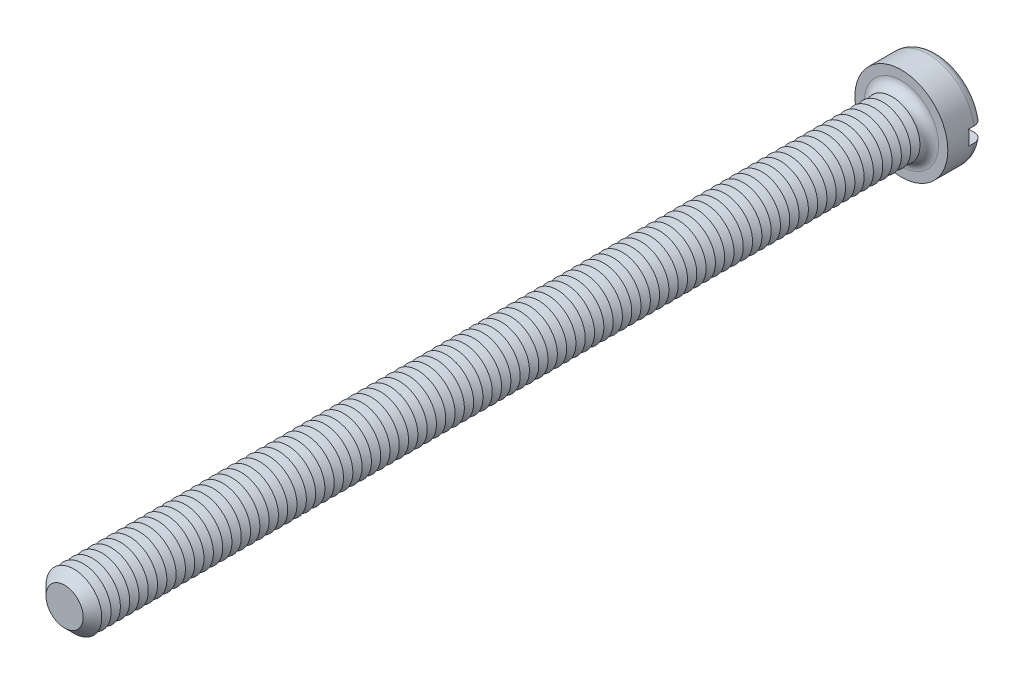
from build123d import *

# Parameters (mm, degrees)
SKETCH3_R           = 5
BOSS_EXTRUDE2_DEPTH = 3.9
SKETCH4_R           = 3
BOSS_EXTRUDE3_DEPTH = 90
FILLET1_R           = 1
CHAMFER1_SIZE       = 1
LPATTERN1_COUNT     = 88
LPATTERN1_PITCH     = 1
SKETCH8_W           = 10
SKETCH8_H           = 1.6
CUT_EXTRUDE1_DEPTH  = 1.6


with BuildPart() as part:
    # Sketch3 → Boss-Extrude2 (new body)
    with BuildSketch(Plane.XY):
        Circle(SKETCH3_R)
    extrude(amount=-BOSS_EXTRUDE2_DEPTH)

    # Sketch4 → Boss-Extrude3 (add)
    with BuildSketch(Plane.XY):
        with Locations(Location((0, 0, 0), (0, 0, 180))):
            Circle(SKETCH4_R)
    extrude(amount=BOSS_EXTRUDE3_DEPTH)

    # Fillet1
    fillet1_edges = [part.edges().sort_by_distance(p)[0] for p in [
        (-5, 0, -3.9),
        (3, 0, 0),
    ]]
    fillet(fillet1_edges, radius=FILLET1_R)

    # Chamfer1
    chamfer1_edges = [part.edges().sort_by_distance(p)[0] for p in [
        (3, 0, 90),
    ]]
    chamfer(chamfer1_edges, length=CHAMFER1_SIZE)

    # Sketch6 → Cut-Revolve1 (revolve, cut)
    with BuildSketch(Plane(origin=(0, 0, 0), x_dir=(0, 0, -1), z_dir=(1, 0, 0)), mode=Mode.PRIVATE) as cut_revolve1_sk:
        Polygon((-1, 3), (-1.5, 2.133974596), (-2, 3), align=None)
    cut_revolve1 = revolve(cut_revolve1_sk.sketch.rotate(Axis((0, 0, -1.694361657), (0, 0, 1)), 90), axis=Axis((0, 0, -1.694361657), (0, 0, 1)), mode=Mode.SUBTRACT)

    # LPattern1: Cut-Revolve1 ×88
    with Locations(*[(0, 0, i * LPATTERN1_PITCH) for i in range(1, LPATTERN1_COUNT)]):
        add(cut_revolve1, mode=Mode.SUBTRACT)

    # Sketch8 → Cut-Extrude1 (cut)
    with BuildSketch(Plane(origin=(0, 0, -3.9), x_dir=(-1, 0, 0), z_dir=(0, 0, -1))):
        Rectangle(SKETCH8_W, SKETCH8_H)
    extrude(amount=-CUT_EXTRUDE1_DEPTH, mode=Mode.SUBTRACT)


solid = part.part
